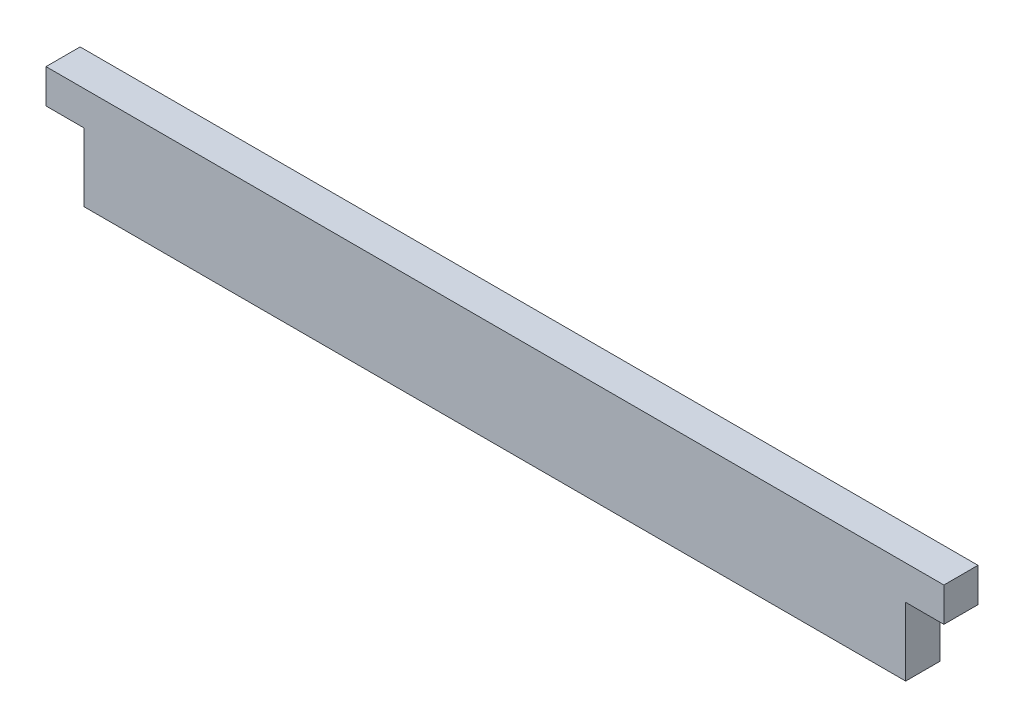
from build123d import *

# Parameters (mm, degrees)
BOSS_EXTRUDE1_DEPTH = 3.175


with BuildPart() as part:
    # Sketch1 → Boss-Extrude1 (new body)
    with BuildSketch(Plane(origin=(0, 0, 0), x_dir=(1, 0, 0), z_dir=(0, 0, -1))):
        Polygon((80.01, 0), (3.556, 0), (3.556, -3.175), (3.556, -6.35), (0, -6.35), (0, -9.525), (83.566, -9.525), (83.566, -6.35), (80.01, -6.35), (80.01, -3.175), align=None)
    extrude(amount=BOSS_EXTRUDE1_DEPTH)


solid = part.part
